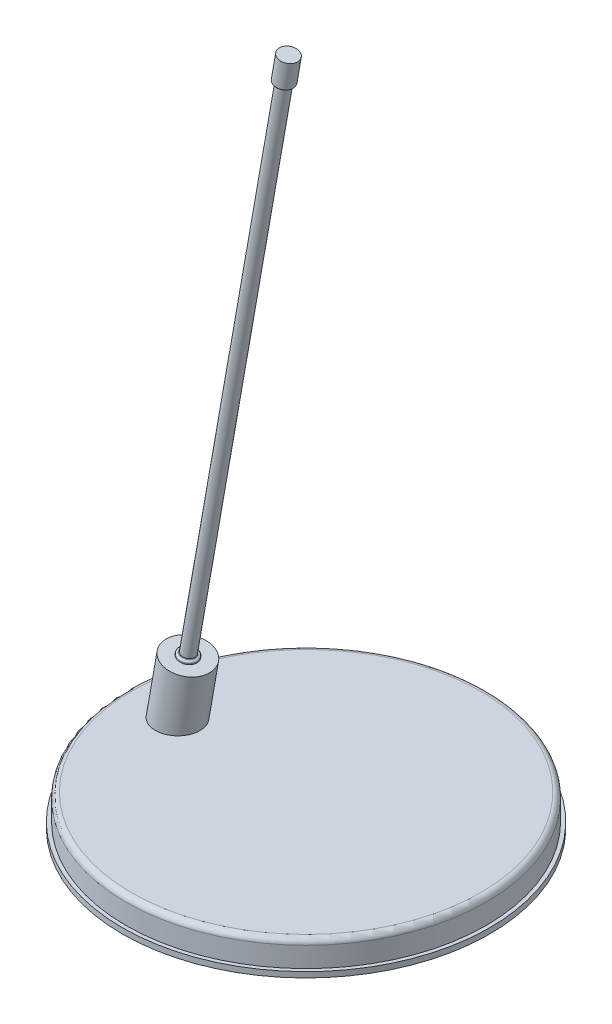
from build123d import *

# Parameters (mm, degrees)
SKETCH1_R           = 50
BOSS_EXTRUDE1_DEPTH = 1.5
SKETCH2_R           = 49
BOSS_EXTRUDE2_DEPTH = 7
FILLET1_R           = 1.5
BOSS_EXTRUDE3_REACH = 101.265
SKETCH4_R           = 6
SKETCH5_R           = 2.5
BOSS_EXTRUDE4_DEPTH = 0.8
FILLET2_R           = 0.5
SKETCH6_R           = 1.75
BOSS_EXTRUDE5_DEPTH = 150
SKETCH7_R           = 2.5
BOSS_EXTRUDE6_DEPTH = 7
FILLET3_R           = 0.1
FILLET4_R           = 0.1


with BuildPart() as part:
    # Sketch1 → Boss-Extrude1 (new body)
    with BuildSketch(Plane(origin=(0, 0, 0), x_dir=(1, 0, 0), z_dir=(0, 1, 0))):
        with Locations(Location((0, 0, 0), (0, 0, 270))):
            Circle(SKETCH1_R)
    extrude(amount=BOSS_EXTRUDE1_DEPTH)


with BuildPart() as body_2:
    # Sketch2 → Boss-Extrude2 (new body)
    with BuildSketch(Plane(origin=(0, 1.5, 0), x_dir=(1, 0, 0), z_dir=(0, 1, 0))):
        with Locations(Location((0, 0, 0), (0, 0, 270))):
            Circle(SKETCH2_R)
    extrude(amount=BOSS_EXTRUDE2_DEPTH)

    # Fillet1
    fillet1_edges = [body_2.edges().sort_by_distance(p)[0] for p in [
        (0, 8.5, -49),
    ]]
    fillet(fillet1_edges, radius=FILLET1_R)

    # Boss-Extrude3: up to this plane
    boss_extrude3_end = Plane(origin=(0, 8.5, 0), z_dir=(0, 1, 0))
    # Sketch4 → Boss-Extrude3 (add, up to the surface)
    with BuildSketch(Plane(origin=(-32.178768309, 24.5, 0), x_dir=(0.9848077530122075, -0.17364817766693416, 0), z_dir=(0.17364817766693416, 0.9848077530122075, 0)), mode=Mode.PRIVATE) as boss_extrude3_sk1:
        with Locations(Location((0, 0, 0), (0, 0, 180))):
            Circle(SKETCH4_R)
    boss_extrude3_tool1 = split(extrude(boss_extrude3_sk1.sketch, amount=-BOSS_EXTRUDE3_REACH, mode=Mode.PRIVATE), bisect_by=boss_extrude3_end, keep=Keep.BOTH, mode=Mode.PRIVATE)
    add(boss_extrude3_tool1.solids().sort_by_distance((-32.178768, 24.5, 0))[0])

    # Sketch5 → Boss-Extrude4 (add)
    with BuildSketch(Plane(origin=(3.219438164, 18.25834113, 0), x_dir=(0.9848077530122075, -0.1736481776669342, 0), z_dir=(0.1736481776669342, 0.9848077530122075, 0))):
        with Locations(Location((-35.944280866, 0, 0), (0, 0, 180))):
            Circle(SKETCH5_R)
    extrude(amount=BOSS_EXTRUDE4_DEPTH)

    # Fillet2
    fillet2_edges = [body_2.edges().sort_by_distance(p)[0] for p in [
        (-29.577830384, 24.853725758, 0),
    ]]
    fillet(fillet2_edges, radius=FILLET2_R)

    # Sketch6 → Boss-Extrude5 (add)
    with BuildSketch(Plane(origin=(3.358356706, 19.046187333, 0), x_dir=(0.9848077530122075, -0.17364817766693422, 0), z_dir=(0.17364817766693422, 0.9848077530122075, 0))):
        with Locations(Location((-35.944280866, 0, 0), (0, 0, 180))):
            Circle(SKETCH6_R)
    extrude(amount=BOSS_EXTRUDE5_DEPTH)

    # Sketch7 → Boss-Extrude6 (add)
    with BuildSketch(Plane(origin=(29.405583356, 166.767350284, 0), x_dir=(0.9848077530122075, -0.17364817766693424, 0), z_dir=(0.17364817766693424, 0.9848077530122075, 0))):
        with Locations(Location((-35.944280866, 0, 0), (0, 0, 180))):
            Circle(SKETCH7_R)
    extrude(amount=BOSS_EXTRUDE6_DEPTH)

    # Fillet3
    fillet3_edges = [body_2.edges().sort_by_distance(p)[0] for p in [
        (-30.316436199, 24.983961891, 0),
    ]]
    fillet(fillet3_edges, radius=FILLET3_R)

    # Fillet4
    fillet4_edges = [body_2.edges().sort_by_distance(p)[0] for p in [
        (-3.530603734, 172.57488871, 0),
    ]]
    fillet(fillet4_edges, radius=FILLET4_R)


solid = Compound([part.part, body_2.part])
